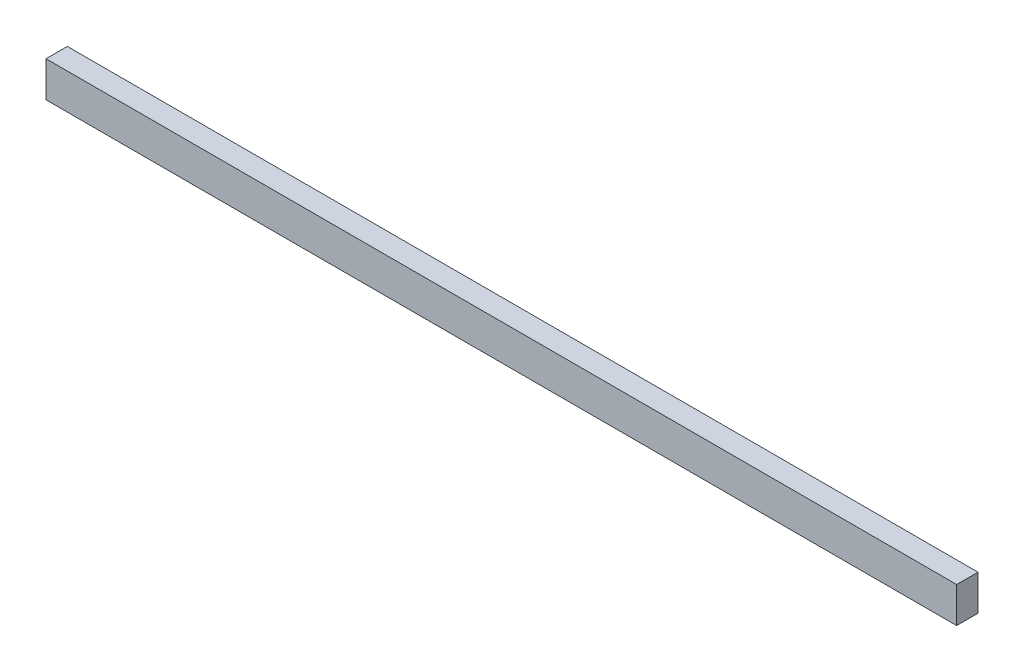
from build123d import *

# Parameters (mm, degrees)
SKETCH1_W            = 63.5
SKETCH1_H            = 38.1
PANEL_OR_BLOCK_DEPTH = 1625.6


with BuildPart() as part:
    # Sketch1 → Panel_or_block (new body)
    with BuildSketch(Plane.YZ):
        with Locations((0, 19.05)):
            Rectangle(SKETCH1_W, SKETCH1_H)
    extrude(amount=PANEL_OR_BLOCK_DEPTH)


solid = part.part
